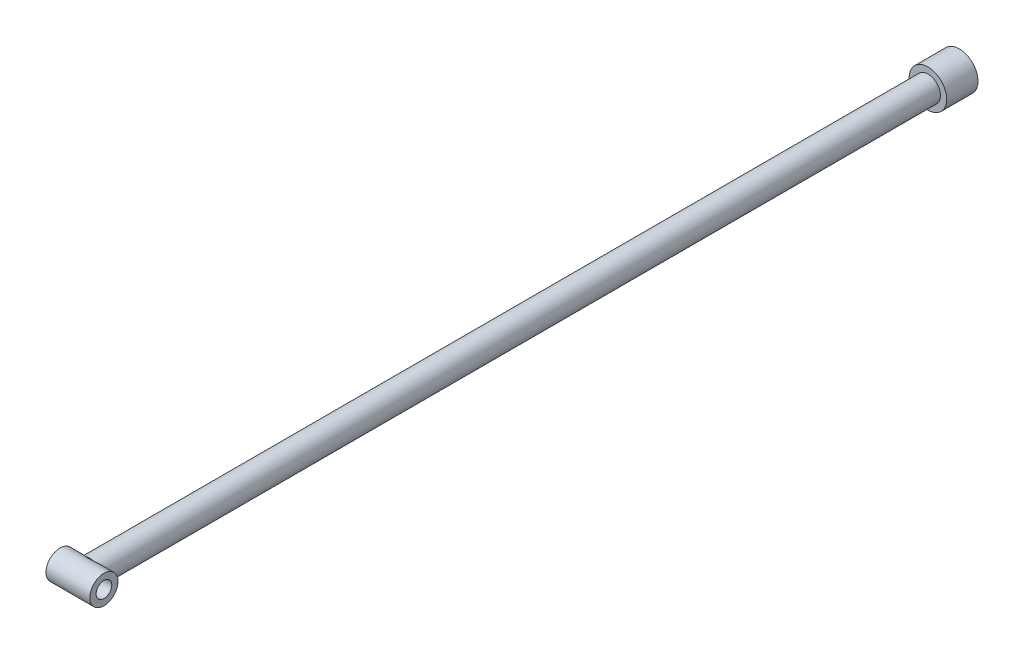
ISO-10303-21;
HEADER;
FILE_DESCRIPTION(('STEP AP214'),'2;1');
FILE_NAME('part.step','',(''),(''),'','','');
FILE_SCHEMA(('AUTOMOTIVE_DESIGN { 1 0 10303 214 1 1 1 1 }'));
ENDSEC;
DATA;
#1=APPLICATION_CONTEXT('core data for automotive mechanical design processes');
#2=APPLICATION_PROTOCOL_DEFINITION('international standard','automotive_design',2000,#1);
#3=PRODUCT_CONTEXT('',#1,'mechanical');
#4=PRODUCT('Part','Part','',(#3));
#5=PRODUCT_RELATED_PRODUCT_CATEGORY('part','',(#4));
#6=PRODUCT_DEFINITION_FORMATION('','',#4);
#7=PRODUCT_DEFINITION_CONTEXT('part definition',#1,'design');
#8=PRODUCT_DEFINITION('design','',#6,#7);
#9=PRODUCT_DEFINITION_SHAPE('','',#8);
#10=(LENGTH_UNIT() NAMED_UNIT(*) SI_UNIT(.MILLI.,.METRE.));
#11=(NAMED_UNIT(*) PLANE_ANGLE_UNIT() SI_UNIT($,.RADIAN.));
#12=(NAMED_UNIT(*) SI_UNIT($,.STERADIAN.) SOLID_ANGLE_UNIT());
#13=UNCERTAINTY_MEASURE_WITH_UNIT(LENGTH_MEASURE(1.E-05),#10,'distance_accuracy_value','');
#14=(GEOMETRIC_REPRESENTATION_CONTEXT(3) GLOBAL_UNCERTAINTY_ASSIGNED_CONTEXT((#13)) GLOBAL_UNIT_ASSIGNED_CONTEXT((#10,
#11,#12)) REPRESENTATION_CONTEXT('',''));
#15=CARTESIAN_POINT('',(0.,0.,0.));
#16=DIRECTION('',(0.,0.,1.));
#17=DIRECTION('',(1.,0.,0.));
#18=AXIS2_PLACEMENT_3D('',#15,#16,#17);
#19=CARTESIAN_POINT('',(0.,0.,1388.));
#20=DIRECTION('',(0.,0.,-1.));
#21=DIRECTION('',(-1.,0.,0.));
#22=AXIS2_PLACEMENT_3D('',#19,#20,#21);
#23=CYLINDRICAL_SURFACE('',#22,20.);
#24=CARTESIAN_POINT('',(0.,0.,50.));
#25=DIRECTION('',(0.,0.,1.));
#26=DIRECTION('',(1.,0.,0.));
#27=AXIS2_PLACEMENT_3D('',#24,#25,#26);
#28=CIRCLE('',#27,20.);
#29=CARTESIAN_POINT('',(20.,0.,50.));
#30=VERTEX_POINT('',#29);
#31=EDGE_CURVE('E111',#30,#30,#28,.T.);
#32=ORIENTED_EDGE('',*,*,#31,.T.);
#33=EDGE_LOOP('',(#32));
#34=FACE_BOUND('',#33,.T.);
#35=CARTESIAN_POINT('',(6.14410286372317,-19.032866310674,1388.));
#36=CARTESIAN_POINT('',(6.45066466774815,-18.9338664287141,1387.84292315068));
#37=CARTESIAN_POINT('',(6.75204866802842,-18.8284322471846,1387.68005730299));
#38=CARTESIAN_POINT('',(7.34495833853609,-18.6051675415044,1387.34544355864));
#39=CARTESIAN_POINT('',(7.63648843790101,-18.4873426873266,1387.17369974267));
#40=CARTESIAN_POINT('',(8.21019129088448,-18.2397963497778,1386.82404539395));
#41=CARTESIAN_POINT('',(8.49237272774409,-18.1100863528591,1386.64614091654));
#42=CARTESIAN_POINT('',(9.04818183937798,-17.8388906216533,1386.28596196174));
#43=CARTESIAN_POINT('',(9.32180836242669,-17.6974033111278,1386.10368690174));
#44=CARTESIAN_POINT('',(10.1356569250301,-17.2526382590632,1385.54932427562));
#45=CARTESIAN_POINT('',(10.6633961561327,-16.9314199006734,1385.17309789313));
#46=CARTESIAN_POINT('',(11.6871113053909,-16.2416839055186,1384.42056750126));
#47=CARTESIAN_POINT('',(12.1830774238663,-15.8731517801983,1384.04426350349));
#48=CARTESIAN_POINT('',(13.1413476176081,-15.0893012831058,1383.30108135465));
#49=CARTESIAN_POINT('',(13.6037366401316,-14.6741082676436,1382.93418105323));
#50=CARTESIAN_POINT('',(14.4939704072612,-13.7955046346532,1382.21641233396));
#51=CARTESIAN_POINT('',(14.9218151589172,-13.3320940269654,1381.86554391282));
#52=CARTESIAN_POINT('',(15.7375382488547,-12.3584501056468,1381.1886044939));
#53=CARTESIAN_POINT('',(16.1255732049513,-11.8484164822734,1380.86243775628));
#54=CARTESIAN_POINT('',(16.6748815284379,-11.0477620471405,1380.39662445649));
#55=CARTESIAN_POINT('',(16.8525031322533,-10.7749861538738,1380.24528011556));
#56=CARTESIAN_POINT('',(17.1961753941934,-10.2175718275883,1379.95129654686));
#57=CARTESIAN_POINT('',(17.3622234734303,-9.93293077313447,1379.80865926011));
#58=CARTESIAN_POINT('',(17.734591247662,-9.25627288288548,1379.48770839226));
#59=CARTESIAN_POINT('',(17.9361258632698,-8.85981025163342,1379.31314815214));
#60=CARTESIAN_POINT('',(18.3149203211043,-8.04763339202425,1378.98387414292));
#61=CARTESIAN_POINT('',(18.4921870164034,-7.63192464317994,1378.82915477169));
#62=CARTESIAN_POINT('',(18.8202247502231,-6.78278757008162,1378.54202784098));
#63=CARTESIAN_POINT('',(18.9710022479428,-6.34936359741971,1378.40961484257));
#64=CARTESIAN_POINT('',(19.2438754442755,-5.46685927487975,1378.16945843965));
#65=CARTESIAN_POINT('',(19.3659702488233,-5.01777843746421,1378.06171580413));
#66=CARTESIAN_POINT('',(19.5801747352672,-4.10350445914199,1377.87239933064));
#67=CARTESIAN_POINT('',(19.6720615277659,-3.63821838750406,1377.79102007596));
#68=CARTESIAN_POINT('',(19.8228748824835,-2.6981842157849,1377.65732448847));
#69=CARTESIAN_POINT('',(19.8818015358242,-2.22343614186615,1377.6050080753));
#70=CARTESIAN_POINT('',(19.9654642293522,-1.26875673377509,1377.53070112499));
#71=CARTESIAN_POINT('',(19.990213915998,-0.788827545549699,1377.50869848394));
#72=CARTESIAN_POINT('',(20.0050293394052,0.171966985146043,1377.4955296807));
#73=CARTESIAN_POINT('',(19.9950982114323,0.652832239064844,1377.50436073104));
#74=CARTESIAN_POINT('',(19.9437521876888,1.55871604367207,1377.54998578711));
#75=CARTESIAN_POINT('',(19.9058905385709,1.98410358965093,1377.58362377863));
#76=CARTESIAN_POINT('',(19.8034720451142,2.82905786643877,1377.67452247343));
#77=CARTESIAN_POINT('',(19.7389175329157,3.24862510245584,1377.73178111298));
#78=CARTESIAN_POINT('',(19.5841352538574,4.07923403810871,1377.86886663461));
#79=CARTESIAN_POINT('',(19.4939065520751,4.4902754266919,1377.94869433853));
#80=CARTESIAN_POINT('',(19.2891006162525,5.30147390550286,1378.12953833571));
#81=CARTESIAN_POINT('',(19.1745220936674,5.70163041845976,1378.23055575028));
#82=CARTESIAN_POINT('',(18.9193219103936,6.49915484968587,1378.45500152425));
#83=CARTESIAN_POINT('',(18.7781098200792,6.89619049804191,1378.578936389));
#84=CARTESIAN_POINT('',(18.4734348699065,7.67509696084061,1378.84551215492));
#85=CARTESIAN_POINT('',(18.3099723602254,8.05696801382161,1378.9881527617));
#86=CARTESIAN_POINT('',(17.9625063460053,8.80444617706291,1379.29023759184));
#87=CARTESIAN_POINT('',(17.7784983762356,9.17004972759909,1379.44968546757));
#88=CARTESIAN_POINT('',(17.391632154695,9.88413402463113,1379.78343972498));
#89=CARTESIAN_POINT('',(17.1887699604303,10.2326111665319,1379.95774921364));
#90=CARTESIAN_POINT('',(16.6614018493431,11.0794696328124,1380.4085385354));
#91=CARTESIAN_POINT('',(16.3262455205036,11.5670208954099,1380.69300971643));
#92=CARTESIAN_POINT('',(15.6218733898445,12.5019985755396,1381.28486117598));
#93=CARTESIAN_POINT('',(15.2526449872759,12.949410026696,1381.59224992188));
#94=CARTESIAN_POINT('',(14.4826187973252,13.8052921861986,1382.22507588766));
#95=CARTESIAN_POINT('',(14.081732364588,14.213645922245,1382.55056297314));
#96=CARTESIAN_POINT('',(13.2518636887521,14.9903696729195,1383.21311898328));
#97=CARTESIAN_POINT('',(12.8228802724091,15.3587380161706,1383.5501883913));
#98=CARTESIAN_POINT('',(11.9190221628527,16.0711660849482,1384.24481862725));
#99=CARTESIAN_POINT('',(11.4429631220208,16.4134725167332,1384.6026331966));
#100=CARTESIAN_POINT('',(10.4620984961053,17.0554425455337,1385.31694584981));
#101=CARTESIAN_POINT('',(9.95730052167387,17.3551173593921,1385.67344425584));
#102=CARTESIAN_POINT('',(9.17918940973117,17.7715543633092,1386.19885754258));
#103=CARTESIAN_POINT('',(8.91720075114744,17.9044827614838,1386.37190306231));
#104=CARTESIAN_POINT('',(8.38539995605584,18.1596269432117,1386.71378863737));
#105=CARTESIAN_POINT('',(8.11558876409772,18.2818440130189,1386.88262919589));
#106=CARTESIAN_POINT('',(7.56743514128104,18.5154760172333,1387.21452851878));
#107=CARTESIAN_POINT('',(7.2890850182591,18.6268808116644,1387.37758176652));
#108=CARTESIAN_POINT('',(6.72342647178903,18.8384300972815,1387.69551552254));
#109=CARTESIAN_POINT('',(6.43611439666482,18.9385699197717,1387.85039262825));
#110=CARTESIAN_POINT('',(6.14410286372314,19.032866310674,1388.));
#111=B_SPLINE_CURVE_WITH_KNOTS('',3,(#35,#36,#37,#38,#39,#40,#41,#42,#43,#44,#45,#46,#47,#48,
#49,#50,#51,#52,#53,#54,#55,#56,#57,#58,#59,#60,#61,#62,#63,#64,#65,#66,#67,#68,#69,#70,#71,#72,
#73,#74,#75,#76,#77,#78,#79,#80,#81,#82,#83,#84,#85,#86,#87,#88,#89,#90,#91,#92,#93,#94,#95,#96,
#97,#98,#99,#100,#101,#102,#103,#104,#105,#106,#107,#108,#109,#110),.UNSPECIFIED.,.F.,.F.,(4,2,
2,2,2,2,2,2,2,2,2,2,2,2,2,2,2,2,2,2,2,2,2,2,2,2,2,2,2,2,2,2,2,2,2,2,2,4),(0.,1.07490746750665,
2.14932518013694,3.22271525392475,4.29624921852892,6.46379001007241,8.63199614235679,
10.7945106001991,12.9570246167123,15.1106754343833,16.1871828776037,17.2639294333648,
18.6958792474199,20.127423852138,21.5586188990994,22.989858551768,24.4314332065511,
25.8730038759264,27.3139987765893,28.7548634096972,30.0385228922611,31.3220702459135,
32.6056643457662,33.889326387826,35.2057748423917,36.5222025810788,37.8389169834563,
39.1559073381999,41.1224172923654,43.0896574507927,45.0626159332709,47.0356568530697,
49.0944838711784,51.1527681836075,52.1754158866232,53.1979406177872,54.2214152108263,
55.2453124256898),.UNSPECIFIED.);
#112=CARTESIAN_POINT('',(6.14410286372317,-19.032866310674,1388.));
#113=VERTEX_POINT('',#112);
#114=CARTESIAN_POINT('',(6.14410286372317,19.032866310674,1388.));
#115=VERTEX_POINT('',#114);
#116=EDGE_CURVE('E109',#113,#115,#111,.T.);
#117=ORIENTED_EDGE('',*,*,#116,.F.);
#118=CARTESIAN_POINT('',(0.,0.,1388.));
#119=DIRECTION('',(0.,0.,1.));
#120=DIRECTION('',(1.,0.,0.));
#121=AXIS2_PLACEMENT_3D('',#118,#119,#120);
#122=CIRCLE('',#121,20.);
#123=CARTESIAN_POINT('',(-6.14410286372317,-19.032866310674,1388.));
#124=VERTEX_POINT('',#123);
#125=EDGE_CURVE('E83',#124,#113,#122,.T.);
#126=ORIENTED_EDGE('',*,*,#125,.F.);
#127=CARTESIAN_POINT('',(-6.14410286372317,19.032866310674,1388.));
#128=CARTESIAN_POINT('',(-6.45066466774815,18.9338664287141,1387.84292315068));
#129=CARTESIAN_POINT('',(-6.75204866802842,18.8284322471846,1387.68005730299));
#130=CARTESIAN_POINT('',(-7.34495833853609,18.6051675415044,1387.34544355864));
#131=CARTESIAN_POINT('',(-7.63648843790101,18.4873426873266,1387.17369974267));
#132=CARTESIAN_POINT('',(-8.21019129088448,18.2397963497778,1386.82404539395));
#133=CARTESIAN_POINT('',(-8.49237272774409,18.1100863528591,1386.64614091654));
#134=CARTESIAN_POINT('',(-9.04818183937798,17.8388906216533,1386.28596196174));
#135=CARTESIAN_POINT('',(-9.32180836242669,17.6974033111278,1386.10368690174));
#136=CARTESIAN_POINT('',(-10.1356569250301,17.2526382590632,1385.54932427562));
#137=CARTESIAN_POINT('',(-10.6633961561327,16.9314199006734,1385.17309789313));
#138=CARTESIAN_POINT('',(-11.6871113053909,16.2416839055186,1384.42056750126));
#139=CARTESIAN_POINT('',(-12.1830774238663,15.8731517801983,1384.04426350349));
#140=CARTESIAN_POINT('',(-13.1413476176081,15.0893012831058,1383.30108135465));
#141=CARTESIAN_POINT('',(-13.6037366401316,14.6741082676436,1382.93418105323));
#142=CARTESIAN_POINT('',(-14.4939704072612,13.7955046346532,1382.21641233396));
#143=CARTESIAN_POINT('',(-14.9218151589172,13.3320940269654,1381.86554391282));
#144=CARTESIAN_POINT('',(-15.7375382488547,12.3584501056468,1381.1886044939));
#145=CARTESIAN_POINT('',(-16.1255732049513,11.8484164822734,1380.86243775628));
#146=CARTESIAN_POINT('',(-16.6748815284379,11.0477620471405,1380.39662445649));
#147=CARTESIAN_POINT('',(-16.8525031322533,10.7749861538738,1380.24528011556));
#148=CARTESIAN_POINT('',(-17.1961753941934,10.2175718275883,1379.95129654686));
#149=CARTESIAN_POINT('',(-17.3622234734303,9.93293077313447,1379.80865926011));
#150=CARTESIAN_POINT('',(-17.734591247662,9.25627288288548,1379.48770839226));
#151=CARTESIAN_POINT('',(-17.9361258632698,8.85981025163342,1379.31314815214));
#152=CARTESIAN_POINT('',(-18.3149203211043,8.04763339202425,1378.98387414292));
#153=CARTESIAN_POINT('',(-18.4921870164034,7.63192464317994,1378.82915477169));
#154=CARTESIAN_POINT('',(-18.8202247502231,6.78278757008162,1378.54202784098));
#155=CARTESIAN_POINT('',(-18.9710022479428,6.34936359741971,1378.40961484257));
#156=CARTESIAN_POINT('',(-19.2438754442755,5.46685927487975,1378.16945843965));
#157=CARTESIAN_POINT('',(-19.3659702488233,5.01777843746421,1378.06171580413));
#158=CARTESIAN_POINT('',(-19.5801747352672,4.10350445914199,1377.87239933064));
#159=CARTESIAN_POINT('',(-19.6720615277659,3.63821838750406,1377.79102007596));
#160=CARTESIAN_POINT('',(-19.8228748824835,2.6981842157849,1377.65732448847));
#161=CARTESIAN_POINT('',(-19.8818015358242,2.22343614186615,1377.6050080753));
#162=CARTESIAN_POINT('',(-19.9654642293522,1.26875673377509,1377.53070112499));
#163=CARTESIAN_POINT('',(-19.990213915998,0.788827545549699,1377.50869848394));
#164=CARTESIAN_POINT('',(-20.0050293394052,-0.171966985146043,1377.4955296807));
#165=CARTESIAN_POINT('',(-19.9950982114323,-0.652832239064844,1377.50436073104));
#166=CARTESIAN_POINT('',(-19.9437521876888,-1.55871604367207,1377.54998578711));
#167=CARTESIAN_POINT('',(-19.9058905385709,-1.98410358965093,1377.58362377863));
#168=CARTESIAN_POINT('',(-19.8034720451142,-2.82905786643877,1377.67452247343));
#169=CARTESIAN_POINT('',(-19.7389175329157,-3.24862510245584,1377.73178111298));
#170=CARTESIAN_POINT('',(-19.5841352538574,-4.07923403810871,1377.86886663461));
#171=CARTESIAN_POINT('',(-19.4939065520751,-4.4902754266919,1377.94869433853));
#172=CARTESIAN_POINT('',(-19.2891006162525,-5.30147390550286,1378.12953833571));
#173=CARTESIAN_POINT('',(-19.1745220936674,-5.70163041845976,1378.23055575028));
#174=CARTESIAN_POINT('',(-18.9193219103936,-6.49915484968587,1378.45500152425));
#175=CARTESIAN_POINT('',(-18.7781098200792,-6.89619049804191,1378.578936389));
#176=CARTESIAN_POINT('',(-18.4734348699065,-7.67509696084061,1378.84551215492));
#177=CARTESIAN_POINT('',(-18.3099723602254,-8.05696801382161,1378.9881527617));
#178=CARTESIAN_POINT('',(-17.9625063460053,-8.80444617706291,1379.29023759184));
#179=CARTESIAN_POINT('',(-17.7784983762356,-9.17004972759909,1379.44968546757));
#180=CARTESIAN_POINT('',(-17.391632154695,-9.88413402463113,1379.78343972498));
#181=CARTESIAN_POINT('',(-17.1887699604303,-10.2326111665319,1379.95774921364));
#182=CARTESIAN_POINT('',(-16.6614018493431,-11.0794696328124,1380.4085385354));
#183=CARTESIAN_POINT('',(-16.3262455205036,-11.5670208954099,1380.69300971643));
#184=CARTESIAN_POINT('',(-15.6218733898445,-12.5019985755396,1381.28486117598));
#185=CARTESIAN_POINT('',(-15.2526449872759,-12.949410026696,1381.59224992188));
#186=CARTESIAN_POINT('',(-14.4826187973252,-13.8052921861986,1382.22507588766));
#187=CARTESIAN_POINT('',(-14.081732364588,-14.213645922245,1382.55056297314));
#188=CARTESIAN_POINT('',(-13.2518636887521,-14.9903696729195,1383.21311898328));
#189=CARTESIAN_POINT('',(-12.8228802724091,-15.3587380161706,1383.5501883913));
#190=CARTESIAN_POINT('',(-11.9190221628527,-16.0711660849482,1384.24481862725));
#191=CARTESIAN_POINT('',(-11.4429631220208,-16.4134725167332,1384.6026331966));
#192=CARTESIAN_POINT('',(-10.4620984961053,-17.0554425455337,1385.31694584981));
#193=CARTESIAN_POINT('',(-9.95730052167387,-17.3551173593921,1385.67344425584));
#194=CARTESIAN_POINT('',(-9.17918940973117,-17.7715543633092,1386.19885754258));
#195=CARTESIAN_POINT('',(-8.91720075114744,-17.9044827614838,1386.37190306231));
#196=CARTESIAN_POINT('',(-8.38539995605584,-18.1596269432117,1386.71378863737));
#197=CARTESIAN_POINT('',(-8.11558876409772,-18.2818440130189,1386.88262919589));
#198=CARTESIAN_POINT('',(-7.56743514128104,-18.5154760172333,1387.21452851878));
#199=CARTESIAN_POINT('',(-7.2890850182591,-18.6268808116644,1387.37758176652));
#200=CARTESIAN_POINT('',(-6.72342647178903,-18.8384300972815,1387.69551552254));
#201=CARTESIAN_POINT('',(-6.43611439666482,-18.9385699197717,1387.85039262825));
#202=CARTESIAN_POINT('',(-6.14410286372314,-19.032866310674,1388.));
#203=B_SPLINE_CURVE_WITH_KNOTS('',3,(#127,#128,#129,#130,#131,#132,#133,#134,#135,#136,#137,
#138,#139,#140,#141,#142,#143,#144,#145,#146,#147,#148,#149,#150,#151,#152,#153,#154,#155,#156,
#157,#158,#159,#160,#161,#162,#163,#164,#165,#166,#167,#168,#169,#170,#171,#172,#173,#174,#175,
#176,#177,#178,#179,#180,#181,#182,#183,#184,#185,#186,#187,#188,#189,#190,#191,#192,#193,#194,
#195,#196,#197,#198,#199,#200,#201,#202),.UNSPECIFIED.,.F.,.F.,(4,2,2,2,2,2,2,2,2,2,2,2,2,2,2,2,
2,2,2,2,2,2,2,2,2,2,2,2,2,2,2,2,2,2,2,2,2,4),(0.,1.07490746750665,2.14932518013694,
3.22271525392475,4.29624921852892,6.46379001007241,8.63199614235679,10.7945106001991,
12.9570246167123,15.1106754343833,16.1871828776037,17.2639294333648,18.6958792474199,
20.127423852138,21.5586188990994,22.989858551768,24.4314332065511,25.8730038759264,
27.3139987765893,28.7548634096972,30.0385228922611,31.3220702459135,32.6056643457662,
33.889326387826,35.2057748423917,36.5222025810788,37.8389169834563,39.1559073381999,
41.1224172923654,43.0896574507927,45.0626159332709,47.0356568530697,49.0944838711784,
51.1527681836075,52.1754158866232,53.1979406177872,54.2214152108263,55.2453124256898),.UNSPECIFIED.);
#204=CARTESIAN_POINT('',(-6.14410286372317,19.032866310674,1388.));
#205=VERTEX_POINT('',#204);
#206=EDGE_CURVE('E58',#205,#124,#203,.T.);
#207=ORIENTED_EDGE('',*,*,#206,.F.);
#208=EDGE_CURVE('E82',#115,#205,#122,.T.);
#209=ORIENTED_EDGE('',*,*,#208,.F.);
#210=EDGE_LOOP('',(#117,#126,#207,#209));
#211=FACE_BOUND('',#210,.T.);
#212=ADVANCED_FACE('F35',(#34,#211),#23,.T.);
#213=CARTESIAN_POINT('',(0.,0.,1388.));
#214=DIRECTION('',(0.,0.,1.));
#215=DIRECTION('',(1.,0.,0.));
#216=AXIS2_PLACEMENT_3D('',#213,#214,#215);
#217=PLANE('',#216);
#218=ORIENTED_EDGE('',*,*,#208,.T.);
#219=DIRECTION('',(-1.,0.,0.));
#220=VECTOR('',#219,1.);
#221=CARTESIAN_POINT('',(35.,19.032866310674,1388.));
#222=LINE('',#221,#220);
#223=EDGE_CURVE('E11',#205,#115,#222,.F.);
#224=ORIENTED_EDGE('',*,*,#223,.T.);
#225=EDGE_LOOP('',(#218,#224));
#226=FACE_BOUND('',#225,.T.);
#227=ADVANCED_FACE('F118',(#226),#217,.T.);
#228=ORIENTED_EDGE('',*,*,#125,.T.);
#229=DIRECTION('',(-1.,0.,0.));
#230=VECTOR('',#229,1.);
#231=CARTESIAN_POINT('',(35.,-19.032866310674,1388.));
#232=LINE('',#231,#230);
#233=EDGE_CURVE('E43',#113,#124,#232,.T.);
#234=ORIENTED_EDGE('',*,*,#233,.T.);
#235=EDGE_LOOP('',(#228,#234));
#236=FACE_BOUND('',#235,.T.);
#237=ADVANCED_FACE('F104',(#236),#217,.T.);
#238=CARTESIAN_POINT('',(0.,0.,50.));
#239=DIRECTION('',(0.,0.,1.));
#240=DIRECTION('',(1.,0.,0.));
#241=AXIS2_PLACEMENT_3D('',#238,#239,#240);
#242=PLANE('',#241);
#243=CARTESIAN_POINT('',(0.,0.,50.));
#244=DIRECTION('',(0.,0.,1.));
#245=DIRECTION('',(1.,0.,0.));
#246=AXIS2_PLACEMENT_3D('',#243,#244,#245);
#247=CIRCLE('',#246,29.9);
#248=CARTESIAN_POINT('',(29.9,0.,50.));
#249=VERTEX_POINT('',#248);
#250=EDGE_CURVE('E94',#249,#249,#247,.T.);
#251=ORIENTED_EDGE('',*,*,#250,.T.);
#252=EDGE_LOOP('',(#251));
#253=FACE_BOUND('',#252,.T.);
#254=ORIENTED_EDGE('',*,*,#31,.F.);
#255=EDGE_LOOP('',(#254));
#256=FACE_BOUND('',#255,.T.);
#257=ADVANCED_FACE('F153',(#253,#256),#242,.T.);
#258=CARTESIAN_POINT('',(0.,0.,50.));
#259=DIRECTION('',(0.,0.,-1.));
#260=DIRECTION('',(-1.,0.,0.));
#261=AXIS2_PLACEMENT_3D('',#258,#259,#260);
#262=CYLINDRICAL_SURFACE('',#261,29.9);
#263=ORIENTED_EDGE('',*,*,#250,.F.);
#264=EDGE_LOOP('',(#263));
#265=FACE_BOUND('',#264,.T.);
#266=CARTESIAN_POINT('',(0.,0.,0.));
#267=DIRECTION('',(0.,0.,1.));
#268=DIRECTION('',(1.,0.,0.));
#269=AXIS2_PLACEMENT_3D('',#266,#267,#268);
#270=CIRCLE('',#269,29.9);
#271=CARTESIAN_POINT('',(29.9,0.,0.));
#272=VERTEX_POINT('',#271);
#273=EDGE_CURVE('E98',#272,#272,#270,.T.);
#274=ORIENTED_EDGE('',*,*,#273,.T.);
#275=EDGE_LOOP('',(#274));
#276=FACE_BOUND('',#275,.T.);
#277=ADVANCED_FACE('F37',(#265,#276),#262,.T.);
#278=CARTESIAN_POINT('',(0.,0.,0.));
#279=DIRECTION('',(0.,0.,1.));
#280=DIRECTION('',(1.,0.,0.));
#281=AXIS2_PLACEMENT_3D('',#278,#279,#280);
#282=PLANE('',#281);
#283=ORIENTED_EDGE('',*,*,#273,.F.);
#284=EDGE_LOOP('',(#283));
#285=FACE_BOUND('',#284,.T.);
#286=ADVANCED_FACE('F182',(#285),#282,.F.);
#287=CARTESIAN_POINT('',(35.,0.,1400.));
#288=DIRECTION('',(1.,0.,0.));
#289=DIRECTION('',(0.,0.,-1.));
#290=AXIS2_PLACEMENT_3D('',#287,#288,#289);
#291=PLANE('',#290);
#292=CARTESIAN_POINT('',(35.,0.,1400.));
#293=DIRECTION('',(1.,0.,0.));
#294=DIRECTION('',(0.,0.,-1.));
#295=AXIS2_PLACEMENT_3D('',#292,#293,#294);
#296=CIRCLE('',#295,22.4999999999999);
#297=CARTESIAN_POINT('',(35.,0.,1377.5));
#298=VERTEX_POINT('',#297);
#299=EDGE_CURVE('E89',#298,#298,#296,.T.);
#300=ORIENTED_EDGE('',*,*,#299,.T.);
#301=EDGE_LOOP('',(#300));
#302=FACE_BOUND('',#301,.T.);
#303=CARTESIAN_POINT('',(35.,0.,1400.));
#304=DIRECTION('',(1.,0.,0.));
#305=DIRECTION('',(0.,0.,-1.));
#306=AXIS2_PLACEMENT_3D('',#303,#304,#305);
#307=CIRCLE('',#306,12.5);
#308=CARTESIAN_POINT('',(35.,0.,1387.5));
#309=VERTEX_POINT('',#308);
#310=EDGE_CURVE('E192',#309,#309,#307,.T.);
#311=ORIENTED_EDGE('',*,*,#310,.F.);
#312=EDGE_LOOP('',(#311));
#313=FACE_BOUND('',#312,.T.);
#314=ADVANCED_FACE('F140',(#302,#313),#291,.T.);
#315=CARTESIAN_POINT('',(-35.,0.,1400.));
#316=DIRECTION('',(1.,0.,0.));
#317=DIRECTION('',(0.,0.,-1.));
#318=AXIS2_PLACEMENT_3D('',#315,#316,#317);
#319=PLANE('',#318);
#320=CARTESIAN_POINT('',(-35.,0.,1400.));
#321=DIRECTION('',(1.,0.,0.));
#322=DIRECTION('',(0.,0.,-1.));
#323=AXIS2_PLACEMENT_3D('',#320,#321,#322);
#324=CIRCLE('',#323,22.4999999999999);
#325=CARTESIAN_POINT('',(-35.,0.,1377.5));
#326=VERTEX_POINT('',#325);
#327=EDGE_CURVE('E187',#326,#326,#324,.T.);
#328=ORIENTED_EDGE('',*,*,#327,.F.);
#329=EDGE_LOOP('',(#328));
#330=FACE_BOUND('',#329,.T.);
#331=CARTESIAN_POINT('',(-35.,0.,1400.));
#332=DIRECTION('',(1.,0.,0.));
#333=DIRECTION('',(0.,0.,-1.));
#334=AXIS2_PLACEMENT_3D('',#331,#332,#333);
#335=CIRCLE('',#334,12.5);
#336=CARTESIAN_POINT('',(-35.,0.,1387.5));
#337=VERTEX_POINT('',#336);
#338=EDGE_CURVE('E190',#337,#337,#335,.T.);
#339=ORIENTED_EDGE('',*,*,#338,.T.);
#340=EDGE_LOOP('',(#339));
#341=FACE_BOUND('',#340,.T.);
#342=ADVANCED_FACE('F138',(#330,#341),#319,.F.);
#343=CARTESIAN_POINT('',(35.,0.,1400.));
#344=DIRECTION('',(-1.,0.,0.));
#345=DIRECTION('',(0.,0.,1.));
#346=AXIS2_PLACEMENT_3D('',#343,#344,#345);
#347=CYLINDRICAL_SURFACE('',#346,22.4999999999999);
#348=CARTESIAN_POINT('',(0.,-22.3313120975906,1402.75));
#349=CARTESIAN_POINT('',(-0.153848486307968,-22.331314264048,1402.74999344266));
#350=CARTESIAN_POINT('',(-0.307793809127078,-22.3329191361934,1402.73704588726));
#351=CARTESIAN_POINT('',(-0.61140210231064,-22.3391629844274,1402.68559912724));
#352=CARTESIAN_POINT('',(-0.761060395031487,-22.3438051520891,1402.64707304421));
#353=CARTESIAN_POINT('',(-1.0516548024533,-22.355590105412,1402.54562024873));
#354=CARTESIAN_POINT('',(-1.19259668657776,-22.3627312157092,1402.48270988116));
#355=CARTESIAN_POINT('',(-1.46189577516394,-22.3787074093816,1402.3343088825));
#356=CARTESIAN_POINT('',(-1.59025516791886,-22.3875421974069,1402.24882218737));
#357=CARTESIAN_POINT('',(-1.83146000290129,-22.4059632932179,1402.05720449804));
#358=CARTESIAN_POINT('',(-1.94422831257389,-22.4155529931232,1401.95097672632));
#359=CARTESIAN_POINT('',(-2.15038386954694,-22.434372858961,1401.72110048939));
#360=CARTESIAN_POINT('',(-2.24377016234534,-22.4436030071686,1401.59745116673));
#361=CARTESIAN_POINT('',(-2.40878641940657,-22.4606983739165,1401.33575824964));
#362=CARTESIAN_POINT('',(-2.48034673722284,-22.4685591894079,1401.19767042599));
#363=CARTESIAN_POINT('',(-2.59923368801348,-22.481992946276,1400.91132523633));
#364=CARTESIAN_POINT('',(-2.64656118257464,-22.4875659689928,1400.7630682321));
#365=CARTESIAN_POINT('',(-2.71540901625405,-22.4957723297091,1400.46138110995));
#366=CARTESIAN_POINT('',(-2.73705744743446,-22.4984202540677,1400.30798062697));
#367=CARTESIAN_POINT('',(-2.75432953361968,-22.500527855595,1399.99970269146));
#368=CARTESIAN_POINT('',(-2.74995416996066,-22.4999876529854,1399.84482529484));
#369=CARTESIAN_POINT('',(-2.71540568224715,-22.4957916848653,1399.53886119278));
#370=CARTESIAN_POINT('',(-2.68537031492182,-22.4921525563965,1399.38775867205));
#371=CARTESIAN_POINT('',(-2.60056966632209,-22.4821863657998,1399.09275506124));
#372=CARTESIAN_POINT('',(-2.5458039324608,-22.4758592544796,1398.94885410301));
#373=CARTESIAN_POINT('',(-2.41295010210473,-22.4611994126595,1398.67191102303));
#374=CARTESIAN_POINT('',(-2.3348022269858,-22.4528615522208,1398.53889786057));
#375=CARTESIAN_POINT('',(-2.15744592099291,-22.4351133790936,1398.28782204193));
#376=CARTESIAN_POINT('',(-2.05823656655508,-22.4257030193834,1398.16976004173));
#377=CARTESIAN_POINT('',(-1.84080154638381,-22.4067907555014,1397.95112887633));
#378=CARTESIAN_POINT('',(-1.72245585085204,-22.3972886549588,1397.85067906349));
#379=CARTESIAN_POINT('',(-1.47052034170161,-22.3793246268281,1397.67105084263));
#380=CARTESIAN_POINT('',(-1.33693048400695,-22.3708627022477,1397.59187249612));
#381=CARTESIAN_POINT('',(-1.05819421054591,-22.3559371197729,1397.45702886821));
#382=CARTESIAN_POINT('',(-0.913043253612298,-22.3494742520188,1397.401372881));
#383=CARTESIAN_POINT('',(-0.615359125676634,-22.339294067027,1397.31525829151));
#384=CARTESIAN_POINT('',(-0.462826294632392,-22.3355766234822,1397.28479853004));
#385=CARTESIAN_POINT('',(-0.155761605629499,-22.3313311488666,1397.25009854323));
#386=CARTESIAN_POINT('',(-0.00124898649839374,-22.3307827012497,1397.24569047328));
#387=CARTESIAN_POINT('',(0.306312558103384,-22.3328833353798,1397.26277638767));
#388=CARTESIAN_POINT('',(0.459361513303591,-22.3355323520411,1397.28426984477));
#389=CARTESIAN_POINT('',(0.759149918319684,-22.3437108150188,1397.35240747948));
#390=CARTESIAN_POINT('',(0.905908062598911,-22.3492309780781,1397.39897061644));
#391=CARTESIAN_POINT('',(1.18953330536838,-22.3625222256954,1397.51584251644));
#392=CARTESIAN_POINT('',(1.32640007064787,-22.3702933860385,1397.58615207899));
#393=CARTESIAN_POINT('',(1.58711748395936,-22.3872599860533,1397.74893462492));
#394=CARTESIAN_POINT('',(1.71089885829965,-22.3964624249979,1397.84151781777));
#395=CARTESIAN_POINT('',(1.9412255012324,-22.4152326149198,1398.04606347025));
#396=CARTESIAN_POINT('',(2.0477701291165,-22.4248003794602,1398.15802664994));
#397=CARTESIAN_POINT('',(2.24118716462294,-22.4432857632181,1398.39888665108));
#398=CARTESIAN_POINT('',(2.32794937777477,-22.4521995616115,1398.52787229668));
#399=CARTESIAN_POINT('',(2.47857676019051,-22.4683157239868,1398.79868301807));
#400=CARTESIAN_POINT('',(2.54244237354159,-22.4755181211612,1398.94050784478));
#401=CARTESIAN_POINT('',(2.64528109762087,-22.487382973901,1399.23260262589));
#402=CARTESIAN_POINT('',(2.68431824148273,-22.4920519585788,1399.38284975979));
#403=CARTESIAN_POINT('',(2.73660029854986,-22.4983509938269,1399.68782673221));
#404=CARTESIAN_POINT('',(2.74984632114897,-22.49998117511,1399.84255637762));
#405=CARTESIAN_POINT('',(2.750150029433,-22.5000183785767,1400.15102943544));
#406=CARTESIAN_POINT('',(2.73737776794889,-22.4984463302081,1400.30477270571));
#407=CARTESIAN_POINT('',(2.68636719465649,-22.4922972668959,1400.60791047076));
#408=CARTESIAN_POINT('',(2.6481288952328,-22.4877202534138,1400.75730496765));
#409=CARTESIAN_POINT('',(2.54732435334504,-22.4760733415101,1401.04748464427));
#410=CARTESIAN_POINT('',(2.48476588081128,-22.4690042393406,1401.18827255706));
#411=CARTESIAN_POINT('',(2.33711441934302,-22.4531565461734,1401.45737866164));
#412=CARTESIAN_POINT('',(2.25202121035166,-22.4443779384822,1401.58569673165));
#413=CARTESIAN_POINT('',(2.06108535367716,-22.4260230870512,1401.82708991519));
#414=CARTESIAN_POINT('',(1.95511611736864,-22.4164421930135,1401.94006455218));
#415=CARTESIAN_POINT('',(1.72569826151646,-22.3976001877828,1402.14669522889));
#416=CARTESIAN_POINT('',(1.60224550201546,-22.3883391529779,1402.24034668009));
#417=CARTESIAN_POINT('',(1.34084393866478,-22.3711489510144,1402.40596636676));
#418=CARTESIAN_POINT('',(1.20284325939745,-22.3632248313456,1402.47785320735));
#419=CARTESIAN_POINT('',(0.916710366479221,-22.3496648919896,1402.59733078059));
#420=CARTESIAN_POINT('',(0.76858942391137,-22.3440265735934,1402.64494805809));
#421=CARTESIAN_POINT('',(0.516410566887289,-22.3370521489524,1402.70307658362));
#422=CARTESIAN_POINT('',(0.413946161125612,-22.3349102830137,1402.7206477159));
#423=CARTESIAN_POINT('',(0.207669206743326,-22.3320395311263,1402.74411159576));
#424=CARTESIAN_POINT('',(0.103856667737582,-22.3313106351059,1402.75000442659));
#425=CARTESIAN_POINT('',(0.,-22.3313120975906,1402.75));
#426=B_SPLINE_CURVE_WITH_KNOTS('',3,(#348,#349,#350,#351,#352,#353,#354,#355,#356,#357,#358,
#359,#360,#361,#362,#363,#364,#365,#366,#367,#368,#369,#370,#371,#372,#373,#374,#375,#376,#377,
#378,#379,#380,#381,#382,#383,#384,#385,#386,#387,#388,#389,#390,#391,#392,#393,#394,#395,#396,
#397,#398,#399,#400,#401,#402,#403,#404,#405,#406,#407,#408,#409,#410,#411,#412,#413,#414,#415,
#416,#417,#418,#419,#420,#421,#422,#423,#424,#425),.UNSPECIFIED.,.T.,.F.,(4,2,2,2,2,2,2,2,2,2,2,
2,2,2,2,2,2,2,2,2,2,2,2,2,2,2,2,2,2,2,2,2,2,2,2,2,2,2,4),(0.,0.461166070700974,
0.922817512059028,1.38416003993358,1.84542219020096,2.30889036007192,2.77238134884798,
3.23733622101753,3.70227456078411,4.16488381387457,4.62747562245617,5.08759948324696,
5.54773176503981,6.00905061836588,6.47038970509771,6.9347435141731,7.39909866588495,
7.8636371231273,8.32815420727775,8.78967523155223,9.25118686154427,9.71121548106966,
10.1712595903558,10.6336285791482,11.0960147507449,11.5609168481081,12.0258099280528,
12.4894991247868,12.9531683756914,13.413816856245,13.8744651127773,14.3349663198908,
14.7954720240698,15.2588612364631,15.7223603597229,16.1875720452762,16.6522738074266,
16.9635899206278,17.2749038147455),.UNSPECIFIED.);
#427=CARTESIAN_POINT('',(0.,-22.3313120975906,1402.75));
#428=VERTEX_POINT('',#427);
#429=EDGE_CURVE('E193',#428,#428,#426,.T.);
#430=ORIENTED_EDGE('',*,*,#429,.F.);
#431=EDGE_LOOP('',(#430));
#432=FACE_BOUND('',#431,.T.);
#433=ORIENTED_EDGE('',*,*,#223,.F.);
#434=ORIENTED_EDGE('',*,*,#206,.T.);
#435=ORIENTED_EDGE('',*,*,#233,.F.);
#436=ORIENTED_EDGE('',*,*,#116,.T.);
#437=EDGE_LOOP('',(#433,#434,#435,#436));
#438=FACE_BOUND('',#437,.T.);
#439=ORIENTED_EDGE('',*,*,#299,.F.);
#440=EDGE_LOOP('',(#439));
#441=FACE_BOUND('',#440,.T.);
#442=ORIENTED_EDGE('',*,*,#327,.T.);
#443=EDGE_LOOP('',(#442));
#444=FACE_BOUND('',#443,.T.);
#445=ADVANCED_FACE('F119',(#432,#438,#441,#444),#347,.T.);
#446=CARTESIAN_POINT('',(35.,0.,1400.));
#447=DIRECTION('',(-1.,0.,0.));
#448=DIRECTION('',(0.,0.,1.));
#449=AXIS2_PLACEMENT_3D('',#446,#447,#448);
#450=CYLINDRICAL_SURFACE('',#449,12.5);
#451=CARTESIAN_POINT('',(0.,-12.1937483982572,1402.75));
#452=CARTESIAN_POINT('',(-0.152449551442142,-12.1937514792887,1402.74999478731));
#453=CARTESIAN_POINT('',(-0.304961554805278,-12.1966384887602,1402.73728004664));
#454=CARTESIAN_POINT('',(-0.605646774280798,-12.2078530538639,1402.68681365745));
#455=CARTESIAN_POINT('',(-0.753816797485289,-12.2161845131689,1402.64904404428));
#456=CARTESIAN_POINT('',(-1.04142504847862,-12.2372997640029,1402.54971607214));
#457=CARTESIAN_POINT('',(-1.18087272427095,-12.2500786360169,1402.48818398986));
#458=CARTESIAN_POINT('',(-1.44746924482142,-12.2786429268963,1402.3431531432));
#459=CARTESIAN_POINT('',(-1.57461831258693,-12.2944282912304,1402.25965477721));
#460=CARTESIAN_POINT('',(-1.81518290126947,-12.3275283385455,1402.07154056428));
#461=CARTESIAN_POINT('',(-1.9283576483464,-12.34486277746,1401.96662023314));
#462=CARTESIAN_POINT('',(-2.13565179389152,-12.3789349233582,1401.73929763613));
#463=CARTESIAN_POINT('',(-2.22976970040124,-12.3956725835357,1401.61689400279));
#464=CARTESIAN_POINT('',(-2.39723216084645,-12.4268805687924,1401.35646375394));
#465=CARTESIAN_POINT('',(-2.47034494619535,-12.441324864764,1401.21828471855));
#466=CARTESIAN_POINT('',(-2.59222200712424,-12.4660953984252,1400.93123053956));
#467=CARTESIAN_POINT('',(-2.64098904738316,-12.4764221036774,1400.78235661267));
#468=CARTESIAN_POINT('',(-2.71203249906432,-12.4916543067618,1400.48064238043));
#469=CARTESIAN_POINT('',(-2.73471646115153,-12.4966431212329,1400.32790231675));
#470=CARTESIAN_POINT('',(-2.75422427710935,-12.5009261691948,1400.02070860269));
#471=CARTESIAN_POINT('',(-2.75105112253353,-12.5002210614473,1399.8662551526));
#472=CARTESIAN_POINT('',(-2.71923791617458,-12.4932593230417,1399.56282922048));
#473=CARTESIAN_POINT('',(-2.69103717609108,-12.4870984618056,1399.41380815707));
#474=CARTESIAN_POINT('',(-2.61066960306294,-12.4700266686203,1399.12266691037));
#475=CARTESIAN_POINT('',(-2.55850167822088,-12.4591155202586,1398.9805470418));
#476=CARTESIAN_POINT('',(-2.43129328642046,-12.4336154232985,1398.70602530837));
#477=CARTESIAN_POINT('',(-2.35608668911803,-12.4189998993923,1398.57370299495));
#478=CARTESIAN_POINT('',(-2.18505975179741,-12.3876929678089,1398.32339690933));
#479=CARTESIAN_POINT('',(-2.08923657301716,-12.3710012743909,1398.20541511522));
#480=CARTESIAN_POINT('',(-1.87730619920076,-12.336962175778,1397.98452603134));
#481=CARTESIAN_POINT('',(-1.76081453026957,-12.3196083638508,1397.88198828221));
#482=CARTESIAN_POINT('',(-1.51210957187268,-12.2865297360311,1397.69783436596));
#483=CARTESIAN_POINT('',(-1.37989584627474,-12.270804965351,1397.61621877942));
#484=CARTESIAN_POINT('',(-1.10289752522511,-12.2427476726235,1397.47605901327));
#485=CARTESIAN_POINT('',(-0.958076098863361,-12.230425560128,1397.41758539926));
#486=CARTESIAN_POINT('',(-0.660327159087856,-12.2107124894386,1397.3259166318));
#487=CARTESIAN_POINT('',(-0.507400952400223,-12.2033207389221,1397.29271741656));
#488=CARTESIAN_POINT('',(-0.201162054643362,-12.1944670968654,1397.25311456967));
#489=CARTESIAN_POINT('',(-0.0479223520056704,-12.1928860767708,1397.24617253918));
#490=CARTESIAN_POINT('',(0.25752480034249,-12.1955114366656,1397.257822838));
#491=CARTESIAN_POINT('',(0.40973232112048,-12.1997174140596,1397.27641339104));
#492=CARTESIAN_POINT('',(0.706915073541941,-12.2133303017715,1397.33813381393));
#493=CARTESIAN_POINT('',(0.851955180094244,-12.2226741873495,1397.38096649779));
#494=CARTESIAN_POINT('',(1.13279996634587,-12.2454531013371,1397.48963324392));
#495=CARTESIAN_POINT('',(1.26860375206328,-12.2588885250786,1397.55546952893));
#496=CARTESIAN_POINT('',(1.52944899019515,-12.2885979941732,1397.70945852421));
#497=CARTESIAN_POINT('',(1.65429011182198,-12.3049129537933,1397.79794252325));
#498=CARTESIAN_POINT('',(1.88754951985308,-12.338435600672,1397.99428228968));
#499=CARTESIAN_POINT('',(1.99596573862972,-12.355643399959,1398.10214049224));
#500=CARTESIAN_POINT('',(2.19539107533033,-12.389405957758,1398.33660465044));
#501=CARTESIAN_POINT('',(2.28603291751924,-12.4059422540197,1398.46352610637));
#502=CARTESIAN_POINT('',(2.44470850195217,-12.4361573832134,1398.73110660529));
#503=CARTESIAN_POINT('',(2.51274330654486,-12.4498363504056,1398.87176500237));
#504=CARTESIAN_POINT('',(2.62376381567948,-12.4727178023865,1399.16194517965));
#505=CARTESIAN_POINT('',(2.66690923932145,-12.4819487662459,1399.31140350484));
#506=CARTESIAN_POINT('',(2.72742440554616,-12.49501733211,1399.61567313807));
#507=CARTESIAN_POINT('',(2.74479794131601,-12.4988557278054,1399.77048365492));
#508=CARTESIAN_POINT('',(2.75310394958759,-12.5006827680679,1400.07757799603));
#509=CARTESIAN_POINT('',(2.74458452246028,-12.4987926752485,1400.22984653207));
#510=CARTESIAN_POINT('',(2.70257355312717,-12.4896352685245,1400.53072489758));
#511=CARTESIAN_POINT('',(2.6690824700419,-12.4823680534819,1400.67933479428));
#512=CARTESIAN_POINT('',(2.57834282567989,-12.4632823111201,1400.9682476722));
#513=CARTESIAN_POINT('',(2.52117283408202,-12.451478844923,1401.10857638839));
#514=CARTESIAN_POINT('',(2.38477450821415,-12.4245803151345,1401.37772220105));
#515=CARTESIAN_POINT('',(2.30554400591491,-12.4094849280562,1401.50653816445));
#516=CARTESIAN_POINT('',(2.12549095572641,-12.3772871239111,1401.75167261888));
#517=CARTESIAN_POINT('',(2.02428347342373,-12.3601517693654,1401.8677040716));
#518=CARTESIAN_POINT('',(1.80392471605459,-12.3259815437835,1402.08132391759));
#519=CARTESIAN_POINT('',(1.68476911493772,-12.3089466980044,1402.17890785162));
#520=CARTESIAN_POINT('',(1.42995294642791,-12.2766484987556,1402.35413868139));
#521=CARTESIAN_POINT('',(1.29409045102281,-12.2614123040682,1402.43149723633));
#522=CARTESIAN_POINT('',(1.01098646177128,-12.2347788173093,1402.56216078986));
#523=CARTESIAN_POINT('',(0.863754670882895,-12.2233782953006,1402.6154860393));
#524=CARTESIAN_POINT('',(0.596989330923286,-12.2078025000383,1402.68710853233));
#525=CARTESIAN_POINT('',(0.478896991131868,-12.202567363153,1402.71064737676));
#526=CARTESIAN_POINT('',(0.240549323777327,-12.1955391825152,1402.74209477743));
#527=CARTESIAN_POINT('',(0.120294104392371,-12.1937459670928,1402.7500041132));
#528=CARTESIAN_POINT('',(0.,-12.1937483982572,1402.75));
#529=B_SPLINE_CURVE_WITH_KNOTS('',3,(#451,#452,#453,#454,#455,#456,#457,#458,#459,#460,#461,
#462,#463,#464,#465,#466,#467,#468,#469,#470,#471,#472,#473,#474,#475,#476,#477,#478,#479,#480,
#481,#482,#483,#484,#485,#486,#487,#488,#489,#490,#491,#492,#493,#494,#495,#496,#497,#498,#499,
#500,#501,#502,#503,#504,#505,#506,#507,#508,#509,#510,#511,#512,#513,#514,#515,#516,#517,#518,
#519,#520,#521,#522,#523,#524,#525,#526,#527,#528),.UNSPECIFIED.,.T.,.F.,(4,2,2,2,2,2,2,2,2,2,2,
2,2,2,2,2,2,2,2,2,2,2,2,2,2,2,2,2,2,2,2,2,2,2,2,2,2,2,4),(0.,0.456907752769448,
0.914143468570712,1.37087501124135,1.82759827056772,2.29133235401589,2.75510272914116,
3.22380935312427,3.69246273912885,4.15368936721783,4.61486263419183,5.06809754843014,
5.5213531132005,5.97795723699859,6.4346242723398,6.90090287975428,7.36719442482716,
7.83489705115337,8.30252449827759,8.76050965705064,9.21846295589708,9.67092013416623,
10.1234210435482,10.5829625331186,11.0425618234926,11.5108380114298,11.9790921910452,
12.4443070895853,12.9094535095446,13.3648228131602,13.8201837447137,14.2740456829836,
14.7279522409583,15.1905633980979,15.6532862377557,16.122284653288,16.5908871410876,
16.9514395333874,17.3119739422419),.UNSPECIFIED.);
#530=CARTESIAN_POINT('',(0.,-12.1937483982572,1402.75));
#531=VERTEX_POINT('',#530);
#532=EDGE_CURVE('E198',#531,#531,#529,.T.);
#533=ORIENTED_EDGE('',*,*,#532,.T.);
#534=EDGE_LOOP('',(#533));
#535=FACE_BOUND('',#534,.T.);
#536=CARTESIAN_POINT('',(-19.6913686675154,3.4999999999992,1388.));
#537=CARTESIAN_POINT('',(-19.7173193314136,3.35400516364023,1387.95741794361));
#538=CARTESIAN_POINT('',(-19.7417712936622,3.20700305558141,1387.91743418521));
#539=CARTESIAN_POINT('',(-19.7875590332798,2.91117019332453,1387.84276474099));
#540=CARTESIAN_POINT('',(-19.8088946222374,2.76233932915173,1387.8080793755));
#541=CARTESIAN_POINT('',(-19.8680450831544,2.3134023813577,1387.71212891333));
#542=CARTESIAN_POINT('',(-19.9010024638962,2.01085856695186,1387.6589713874));
#543=CARTESIAN_POINT('',(-19.9524573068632,1.40993267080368,1387.57616929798));
#544=CARTESIAN_POINT('',(-19.9713276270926,1.11166507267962,1387.54591810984));
#545=CARTESIAN_POINT('',(-19.995655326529,0.513226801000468,1387.50694324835));
#546=CARTESIAN_POINT('',(-20.0011156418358,0.213056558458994,1387.49821486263));
#547=CARTESIAN_POINT('',(-19.9985671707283,-0.372968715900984,1387.50229263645));
#548=CARTESIAN_POINT('',(-19.9911787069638,-0.658834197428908,1387.51410701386));
#549=CARTESIAN_POINT('',(-19.9642685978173,-1.22855306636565,1387.55723940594));
#550=CARTESIAN_POINT('',(-19.9447453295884,-1.51240617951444,1387.58856002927));
#551=CARTESIAN_POINT('',(-19.8932626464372,-2.08386589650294,1387.67145446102));
#552=CARTESIAN_POINT('',(-19.8609821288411,-2.37136736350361,1387.72355155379));
#553=CARTESIAN_POINT('',(-19.7847492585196,-2.94050449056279,1387.84728519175));
#554=CARTESIAN_POINT('',(-19.740799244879,-3.22214131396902,1387.91891782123));
#555=CARTESIAN_POINT('',(-19.6913686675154,-3.4999999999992,1388.));
#556=B_SPLINE_CURVE_WITH_KNOTS('',3,(#536,#537,#538,#539,#540,#541,#542,#543,#544,#545,#546,
#547,#548,#549,#550,#551,#552,#553,#554,#555),.UNSPECIFIED.,.F.,.F.,(4,2,2,2,2,2,2,2,2,4),(0.,
0.462762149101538,0.925552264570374,1.85115343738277,2.7512907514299,3.65123096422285,
4.50892005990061,5.36672388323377,6.24765518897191,7.12841005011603),.UNSPECIFIED.);
#557=CARTESIAN_POINT('',(-19.6913686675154,3.4999999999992,1388.));
#558=VERTEX_POINT('',#557);
#559=CARTESIAN_POINT('',(-19.6913686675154,-3.4999999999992,1388.));
#560=VERTEX_POINT('',#559);
#561=EDGE_CURVE('E85',#558,#560,#556,.T.);
#562=ORIENTED_EDGE('',*,*,#561,.F.);
#563=DIRECTION('',(-1.,0.,0.));
#564=VECTOR('',#563,1.);
#565=CARTESIAN_POINT('',(35.,3.4999999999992,1388.));
#566=LINE('',#565,#564);
#567=CARTESIAN_POINT('',(19.6913686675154,3.4999999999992,1388.));
#568=VERTEX_POINT('',#567);
#569=EDGE_CURVE('E79',#558,#568,#566,.F.);
#570=ORIENTED_EDGE('',*,*,#569,.T.);
#571=CARTESIAN_POINT('',(19.6913686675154,-3.4999999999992,1388.));
#572=CARTESIAN_POINT('',(19.7173193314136,-3.35400516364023,1387.95741794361));
#573=CARTESIAN_POINT('',(19.7417712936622,-3.20700305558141,1387.91743418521));
#574=CARTESIAN_POINT('',(19.7875590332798,-2.91117019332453,1387.84276474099));
#575=CARTESIAN_POINT('',(19.8088946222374,-2.76233932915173,1387.8080793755));
#576=CARTESIAN_POINT('',(19.8680450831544,-2.3134023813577,1387.71212891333));
#577=CARTESIAN_POINT('',(19.9010024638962,-2.01085856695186,1387.6589713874));
#578=CARTESIAN_POINT('',(19.9524573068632,-1.40993267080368,1387.57616929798));
#579=CARTESIAN_POINT('',(19.9713276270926,-1.11166507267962,1387.54591810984));
#580=CARTESIAN_POINT('',(19.995655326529,-0.513226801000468,1387.50694324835));
#581=CARTESIAN_POINT('',(20.0011156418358,-0.213056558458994,1387.49821486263));
#582=CARTESIAN_POINT('',(19.9985671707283,0.372968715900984,1387.50229263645));
#583=CARTESIAN_POINT('',(19.9911787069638,0.658834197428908,1387.51410701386));
#584=CARTESIAN_POINT('',(19.9642685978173,1.22855306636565,1387.55723940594));
#585=CARTESIAN_POINT('',(19.9447453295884,1.51240617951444,1387.58856002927));
#586=CARTESIAN_POINT('',(19.8932626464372,2.08386589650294,1387.67145446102));
#587=CARTESIAN_POINT('',(19.8609821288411,2.37136736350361,1387.72355155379));
#588=CARTESIAN_POINT('',(19.7847492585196,2.94050449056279,1387.84728519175));
#589=CARTESIAN_POINT('',(19.740799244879,3.22214131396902,1387.91891782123));
#590=CARTESIAN_POINT('',(19.6913686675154,3.4999999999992,1388.));
#591=B_SPLINE_CURVE_WITH_KNOTS('',3,(#571,#572,#573,#574,#575,#576,#577,#578,#579,#580,#581,
#582,#583,#584,#585,#586,#587,#588,#589,#590),.UNSPECIFIED.,.F.,.F.,(4,2,2,2,2,2,2,2,2,4),(0.,
0.462762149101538,0.925552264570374,1.85115343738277,2.7512907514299,3.65123096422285,
4.50892005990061,5.36672388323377,6.24765518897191,7.12841005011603),.UNSPECIFIED.);
#592=CARTESIAN_POINT('',(19.6913686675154,-3.4999999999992,1388.));
#593=VERTEX_POINT('',#592);
#594=EDGE_CURVE('E88',#593,#568,#591,.T.);
#595=ORIENTED_EDGE('',*,*,#594,.F.);
#596=DIRECTION('',(-1.,0.,0.));
#597=VECTOR('',#596,1.);
#598=CARTESIAN_POINT('',(35.,-3.4999999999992,1388.));
#599=LINE('',#598,#597);
#600=EDGE_CURVE('E50',#593,#560,#599,.T.);
#601=ORIENTED_EDGE('',*,*,#600,.T.);
#602=EDGE_LOOP('',(#562,#570,#595,#601));
#603=FACE_BOUND('',#602,.T.);
#604=ORIENTED_EDGE('',*,*,#310,.T.);
#605=EDGE_LOOP('',(#604));
#606=FACE_BOUND('',#605,.T.);
#607=ORIENTED_EDGE('',*,*,#338,.F.);
#608=EDGE_LOOP('',(#607));
#609=FACE_BOUND('',#608,.T.);
#610=ADVANCED_FACE('F92',(#535,#603,#606,#609),#450,.F.);
#611=ORIENTED_EDGE('',*,*,#569,.F.);
#612=EDGE_CURVE('E75',#558,#560,#122,.T.);
#613=ORIENTED_EDGE('',*,*,#612,.T.);
#614=ORIENTED_EDGE('',*,*,#600,.F.);
#615=EDGE_CURVE('E110',#593,#568,#122,.T.);
#616=ORIENTED_EDGE('',*,*,#615,.T.);
#617=EDGE_LOOP('',(#611,#613,#614,#616));
#618=FACE_BOUND('',#617,.T.);
#619=ADVANCED_FACE('F77',(#618),#217,.T.);
#620=ORIENTED_EDGE('',*,*,#612,.F.);
#621=ORIENTED_EDGE('',*,*,#561,.T.);
#622=EDGE_LOOP('',(#620,#621));
#623=FACE_BOUND('',#622,.T.);
#624=ADVANCED_FACE('F86',(#623),#23,.T.);
#625=ORIENTED_EDGE('',*,*,#615,.F.);
#626=ORIENTED_EDGE('',*,*,#594,.T.);
#627=EDGE_LOOP('',(#625,#626));
#628=FACE_BOUND('',#627,.T.);
#629=ADVANCED_FACE('F148',(#628),#23,.T.);
#630=CARTESIAN_POINT('',(0.,-29.901,1400.));
#631=DIRECTION('',(0.,1.,0.));
#632=DIRECTION('',(0.,0.,1.));
#633=AXIS2_PLACEMENT_3D('',#630,#631,#632);
#634=CYLINDRICAL_SURFACE('',#633,2.74999999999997);
#635=ORIENTED_EDGE('',*,*,#532,.F.);
#636=EDGE_LOOP('',(#635));
#637=FACE_BOUND('',#636,.T.);
#638=ORIENTED_EDGE('',*,*,#429,.T.);
#639=EDGE_LOOP('',(#638));
#640=FACE_BOUND('',#639,.T.);
#641=ADVANCED_FACE('F159',(#637,#640),#634,.F.);
#642=CLOSED_SHELL('',(#212,#227,#237,#257,#277,#286,#314,#342,#445,#610,#619,#624,#629,#641));
#643=MANIFOLD_SOLID_BREP('B2',#642);
#644=ADVANCED_BREP_SHAPE_REPRESENTATION('',(#18,#643),#14);
#645=SHAPE_DEFINITION_REPRESENTATION(#9,#644);
ENDSEC;
END-ISO-10303-21;
